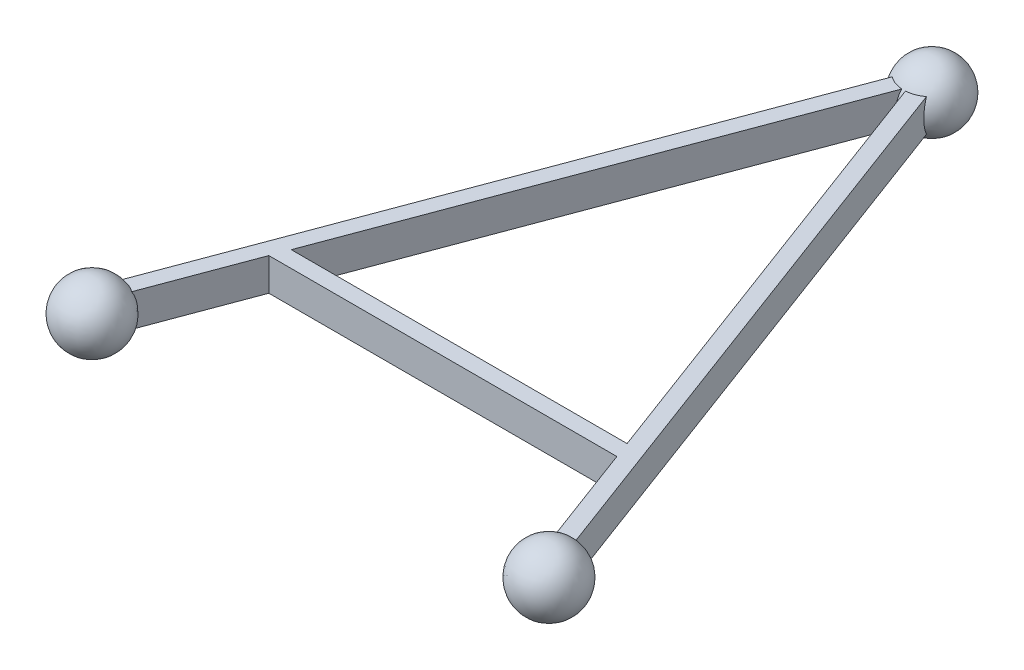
ISO-10303-21;
HEADER;
FILE_DESCRIPTION(('STEP AP214'),'2;1');
FILE_NAME('part.step','',(''),(''),'','','');
FILE_SCHEMA(('AUTOMOTIVE_DESIGN { 1 0 10303 214 1 1 1 1 }'));
ENDSEC;
DATA;
#1=APPLICATION_CONTEXT('core data for automotive mechanical design processes');
#2=APPLICATION_PROTOCOL_DEFINITION('international standard','automotive_design',2000,#1);
#3=PRODUCT_CONTEXT('',#1,'mechanical');
#4=PRODUCT('Part','Part','',(#3));
#5=PRODUCT_RELATED_PRODUCT_CATEGORY('part','',(#4));
#6=PRODUCT_DEFINITION_FORMATION('','',#4);
#7=PRODUCT_DEFINITION_CONTEXT('part definition',#1,'design');
#8=PRODUCT_DEFINITION('design','',#6,#7);
#9=PRODUCT_DEFINITION_SHAPE('','',#8);
#10=(LENGTH_UNIT() NAMED_UNIT(*) SI_UNIT(.MILLI.,.METRE.));
#11=(NAMED_UNIT(*) PLANE_ANGLE_UNIT() SI_UNIT($,.RADIAN.));
#12=(NAMED_UNIT(*) SI_UNIT($,.STERADIAN.) SOLID_ANGLE_UNIT());
#13=UNCERTAINTY_MEASURE_WITH_UNIT(LENGTH_MEASURE(1.E-05),#10,'distance_accuracy_value','');
#14=(GEOMETRIC_REPRESENTATION_CONTEXT(3) GLOBAL_UNCERTAINTY_ASSIGNED_CONTEXT((#13)) GLOBAL_UNIT_ASSIGNED_CONTEXT((#10,
#11,#12)) REPRESENTATION_CONTEXT('',''));
#15=CARTESIAN_POINT('',(0.,0.,0.));
#16=DIRECTION('',(0.,0.,1.));
#17=DIRECTION('',(1.,0.,0.));
#18=AXIS2_PLACEMENT_3D('',#15,#16,#17);
#19=CARTESIAN_POINT('',(-108.484483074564,6.35,-281.279448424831));
#20=DIRECTION('',(0.93674969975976,0.,-0.35));
#21=DIRECTION('',(-0.35,0.,-0.93674969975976));
#22=AXIS2_PLACEMENT_3D('',#19,#20,#21);
#23=PLANE('',#22);
#24=DIRECTION('',(0.35,0.,0.93674969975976));
#25=VECTOR('',#24,1.);
#26=CARTESIAN_POINT('',(-108.484483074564,6.35,-281.279448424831));
#27=LINE('',#26,#25);
#28=CARTESIAN_POINT('',(-21.1836203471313,6.35,-47.625));
#29=VERTEX_POINT('',#28);
#30=CARTESIAN_POINT('',(-6.65977959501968,6.35,-8.75299010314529));
#31=VERTEX_POINT('',#30);
#32=EDGE_CURVE('E55',#29,#31,#27,.T.);
#33=ORIENTED_EDGE('',*,*,#32,.F.);
#34=DIRECTION('',(0.,-1.,0.));
#35=VECTOR('',#34,1.);
#36=CARTESIAN_POINT('',(-21.1836203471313,6.35,-47.625));
#37=LINE('',#36,#35);
#38=CARTESIAN_POINT('',(-21.1836203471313,-6.35000000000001,-47.625));
#39=VERTEX_POINT('',#38);
#40=EDGE_CURVE('E170',#29,#39,#37,.T.);
#41=ORIENTED_EDGE('',*,*,#40,.T.);
#42=DIRECTION('',(0.35,0.,0.93674969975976));
#43=VECTOR('',#42,1.);
#44=CARTESIAN_POINT('',(-108.484483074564,-6.35,-281.279448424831));
#45=LINE('',#44,#43);
#46=CARTESIAN_POINT('',(-6.65977959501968,-6.35,-8.75299010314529));
#47=VERTEX_POINT('',#46);
#48=EDGE_CURVE('E180',#39,#47,#45,.T.);
#49=ORIENTED_EDGE('',*,*,#48,.T.);
#50=CARTESIAN_POINT('',(-2.97418029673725,0.,1.11125));
#51=DIRECTION('',(0.93674969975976,0.,-0.35));
#52=DIRECTION('',(-0.35,0.,-0.93674969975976));
#53=AXIS2_PLACEMENT_3D('',#50,#51,#52);
#54=CIRCLE('',#53,12.2967221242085);
#55=EDGE_CURVE('E203',#31,#47,#54,.F.);
#56=ORIENTED_EDGE('',*,*,#55,.F.);
#57=EDGE_LOOP('',(#33,#41,#49,#56));
#58=FACE_BOUND('',#57,.T.);
#59=ADVANCED_FACE('F32',(#58),#23,.F.);
#60=CARTESIAN_POINT('',(-69.3155169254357,6.35,-281.279448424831));
#61=DIRECTION('',(0.93674969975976,0.,0.35));
#62=DIRECTION('',(0.35,0.,-0.93674969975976));
#63=AXIS2_PLACEMENT_3D('',#60,#61,#62);
#64=PLANE('',#63);
#65=DIRECTION('',(0.,1.,0.));
#66=VECTOR('',#65,1.);
#67=CARTESIAN_POINT('',(-156.616379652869,6.34999999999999,-47.625));
#68=LINE('',#67,#66);
#69=CARTESIAN_POINT('',(-156.616379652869,-6.35,-47.6249999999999));
#70=VERTEX_POINT('',#69);
#71=CARTESIAN_POINT('',(-156.616379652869,6.34999999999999,-47.625));
#72=VERTEX_POINT('',#71);
#73=EDGE_CURVE('E142',#70,#72,#68,.T.);
#74=ORIENTED_EDGE('',*,*,#73,.T.);
#75=DIRECTION('',(-0.35,0.,0.93674969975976));
#76=VECTOR('',#75,1.);
#77=CARTESIAN_POINT('',(-69.3155169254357,6.35,-281.279448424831));
#78=LINE('',#77,#76);
#79=CARTESIAN_POINT('',(-171.14022040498,6.35,-8.75299010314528));
#80=VERTEX_POINT('',#79);
#81=EDGE_CURVE('E165',#72,#80,#78,.T.);
#82=ORIENTED_EDGE('',*,*,#81,.T.);
#83=CARTESIAN_POINT('',(-174.825819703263,0.,1.11125000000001));
#84=DIRECTION('',(0.93674969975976,0.,0.35));
#85=DIRECTION('',(0.35,0.,-0.93674969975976));
#86=AXIS2_PLACEMENT_3D('',#83,#84,#85);
#87=CIRCLE('',#86,12.2967221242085);
#88=CARTESIAN_POINT('',(-171.14022040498,-6.35,-8.75299010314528));
#89=VERTEX_POINT('',#88);
#90=EDGE_CURVE('E152',#89,#80,#87,.T.);
#91=ORIENTED_EDGE('',*,*,#90,.F.);
#92=DIRECTION('',(-0.35,0.,0.93674969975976));
#93=VECTOR('',#92,1.);
#94=CARTESIAN_POINT('',(-69.3155169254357,-6.35,-281.279448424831));
#95=LINE('',#94,#93);
#96=EDGE_CURVE('E149',#70,#89,#95,.T.);
#97=ORIENTED_EDGE('',*,*,#96,.F.);
#98=EDGE_LOOP('',(#74,#82,#91,#97));
#99=FACE_BOUND('',#98,.T.);
#100=ADVANCED_FACE('F232',(#99),#64,.T.);
#101=CARTESIAN_POINT('',(-108.484483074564,-6.35,-281.279448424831));
#102=DIRECTION('',(0.,1.,0.));
#103=DIRECTION('',(-1.,0.,0.));
#104=AXIS2_PLACEMENT_3D('',#101,#102,#103);
#105=PLANE('',#104);
#106=DIRECTION('',(1.,0.,0.));
#107=VECTOR('',#106,1.);
#108=CARTESIAN_POINT('',(-170.108495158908,-6.35000000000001,-53.975));
#109=LINE('',#108,#107);
#110=CARTESIAN_POINT('',(-154.24381417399,-6.35000000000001,-53.975));
#111=VERTEX_POINT('',#110);
#112=CARTESIAN_POINT('',(-23.55618582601,-6.35,-53.9750000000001));
#113=VERTEX_POINT('',#112);
#114=EDGE_CURVE('E121',#111,#113,#109,.T.);
#115=ORIENTED_EDGE('',*,*,#114,.T.);
#116=CARTESIAN_POINT('',(-88.1885809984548,-6.35,-226.958933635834));
#117=VERTEX_POINT('',#116);
#118=EDGE_CURVE('E47',#117,#113,#45,.T.);
#119=ORIENTED_EDGE('',*,*,#118,.F.);
#120=CARTESIAN_POINT('',(-88.9,-6.35,-237.934423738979));
#121=DIRECTION('',(0.,1.,0.));
#122=DIRECTION('',(-1.,0.,0.));
#123=AXIS2_PLACEMENT_3D('',#120,#121,#122);
#124=CIRCLE('',#123,10.9985226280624);
#125=CARTESIAN_POINT('',(-82.2402204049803,-6.35,-229.181433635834));
#126=VERTEX_POINT('',#125);
#127=EDGE_CURVE('E191',#126,#117,#124,.F.);
#128=ORIENTED_EDGE('',*,*,#127,.F.);
#129=DIRECTION('',(0.35,0.,0.93674969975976));
#130=VECTOR('',#129,1.);
#131=CARTESIAN_POINT('',(-102.53612248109,-6.35,-283.501948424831));
#132=LINE('',#131,#130);
#133=CARTESIAN_POINT('',(-0.711419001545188,-6.35,-10.9754901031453));
#134=VERTEX_POINT('',#133);
#135=EDGE_CURVE('E193',#126,#134,#132,.T.);
#136=ORIENTED_EDGE('',*,*,#135,.T.);
#137=CARTESIAN_POINT('',(0.,-6.35,0.));
#138=DIRECTION('',(0.,1.,0.));
#139=DIRECTION('',(-1.,0.,0.));
#140=AXIS2_PLACEMENT_3D('',#137,#138,#139);
#141=CIRCLE('',#140,10.9985226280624);
#142=EDGE_CURVE('E11',#47,#134,#141,.F.);
#143=ORIENTED_EDGE('',*,*,#142,.F.);
#144=ORIENTED_EDGE('',*,*,#48,.F.);
#145=DIRECTION('',(1.,0.,0.));
#146=VECTOR('',#145,1.);
#147=CARTESIAN_POINT('',(-170.108495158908,-6.35000000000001,-47.625));
#148=LINE('',#147,#146);
#149=EDGE_CURVE('E131',#70,#39,#148,.T.);
#150=ORIENTED_EDGE('',*,*,#149,.F.);
#151=ORIENTED_EDGE('',*,*,#96,.T.);
#152=CARTESIAN_POINT('',(-177.8,-6.35,0.));
#153=DIRECTION('',(0.,-1.,0.));
#154=DIRECTION('',(0.,0.,-1.));
#155=AXIS2_PLACEMENT_3D('',#152,#153,#154);
#156=CIRCLE('',#155,10.9985226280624);
#157=CARTESIAN_POINT('',(-177.088580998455,-6.35,-10.9754901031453));
#158=VERTEX_POINT('',#157);
#159=EDGE_CURVE('E148',#158,#89,#156,.T.);
#160=ORIENTED_EDGE('',*,*,#159,.F.);
#161=DIRECTION('',(-0.35,0.,0.93674969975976));
#162=VECTOR('',#161,1.);
#163=CARTESIAN_POINT('',(-75.2638775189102,-6.35,-283.501948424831));
#164=LINE('',#163,#162);
#165=CARTESIAN_POINT('',(-95.5597795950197,-6.35,-229.181433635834));
#166=VERTEX_POINT('',#165);
#167=EDGE_CURVE('E157',#166,#158,#164,.T.);
#168=ORIENTED_EDGE('',*,*,#167,.F.);
#169=CARTESIAN_POINT('',(-88.9,-6.35,-237.934423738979));
#170=DIRECTION('',(0.,-1.,0.));
#171=DIRECTION('',(0.,0.,-1.));
#172=AXIS2_PLACEMENT_3D('',#169,#170,#171);
#173=CIRCLE('',#172,10.9985226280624);
#174=CARTESIAN_POINT('',(-89.6114190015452,-6.35,-226.958933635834));
#175=VERTEX_POINT('',#174);
#176=EDGE_CURVE('E147',#166,#175,#173,.F.);
#177=ORIENTED_EDGE('',*,*,#176,.T.);
#178=EDGE_CURVE('E138',#175,#111,#95,.T.);
#179=ORIENTED_EDGE('',*,*,#178,.T.);
#180=EDGE_LOOP('',(#115,#119,#128,#136,#143,#144,#150,#151,#160,#168,#177,#179));
#181=FACE_BOUND('',#180,.T.);
#182=ADVANCED_FACE('F145',(#181),#105,.F.);
#183=CARTESIAN_POINT('',(-102.53612248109,6.35,-283.501948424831));
#184=DIRECTION('',(-0.93674969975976,0.,0.35));
#185=DIRECTION('',(0.35,0.,0.93674969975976));
#186=AXIS2_PLACEMENT_3D('',#183,#184,#185);
#187=PLANE('',#186);
#188=CARTESIAN_POINT('',(2.97418029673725,0.,-1.11125));
#189=DIRECTION('',(-0.93674969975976,0.,0.35));
#190=DIRECTION('',(0.35,0.,0.93674969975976));
#191=AXIS2_PLACEMENT_3D('',#188,#189,#190);
#192=CIRCLE('',#191,12.2967221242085);
#193=CARTESIAN_POINT('',(-0.711419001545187,6.35,-10.9754901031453));
#194=VERTEX_POINT('',#193);
#195=EDGE_CURVE('E40',#134,#194,#192,.F.);
#196=ORIENTED_EDGE('',*,*,#195,.F.);
#197=ORIENTED_EDGE('',*,*,#135,.F.);
#198=CARTESIAN_POINT('',(-85.9258197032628,0.,-239.045673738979));
#199=DIRECTION('',(-0.93674969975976,0.,0.35));
#200=DIRECTION('',(0.35,0.,0.93674969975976));
#201=AXIS2_PLACEMENT_3D('',#198,#199,#200);
#202=CIRCLE('',#201,12.2967221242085);
#203=CARTESIAN_POINT('',(-82.2402204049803,6.34999999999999,-229.181433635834));
#204=VERTEX_POINT('',#203);
#205=EDGE_CURVE('E181',#204,#126,#202,.F.);
#206=ORIENTED_EDGE('',*,*,#205,.F.);
#207=DIRECTION('',(0.35,0.,0.93674969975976));
#208=VECTOR('',#207,1.);
#209=CARTESIAN_POINT('',(-102.53612248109,6.35,-283.501948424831));
#210=LINE('',#209,#208);
#211=EDGE_CURVE('E196',#204,#194,#210,.T.);
#212=ORIENTED_EDGE('',*,*,#211,.T.);
#213=EDGE_LOOP('',(#196,#197,#206,#212));
#214=FACE_BOUND('',#213,.T.);
#215=ADVANCED_FACE('F212',(#214),#187,.F.);
#216=CARTESIAN_POINT('',(-108.484483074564,6.35,-281.279448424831));
#217=DIRECTION('',(0.,-1.,0.));
#218=DIRECTION('',(1.,0.,0.));
#219=AXIS2_PLACEMENT_3D('',#216,#217,#218);
#220=PLANE('',#219);
#221=DIRECTION('',(1.,0.,0.));
#222=VECTOR('',#221,1.);
#223=CARTESIAN_POINT('',(-170.108495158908,6.34999999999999,-47.625));
#224=LINE('',#223,#222);
#225=EDGE_CURVE('E143',#72,#29,#224,.T.);
#226=ORIENTED_EDGE('',*,*,#225,.T.);
#227=ORIENTED_EDGE('',*,*,#32,.T.);
#228=CARTESIAN_POINT('',(0.,6.35,0.));
#229=DIRECTION('',(0.,-1.,0.));
#230=DIRECTION('',(1.,0.,0.));
#231=AXIS2_PLACEMENT_3D('',#228,#229,#230);
#232=CIRCLE('',#231,10.9985226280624);
#233=EDGE_CURVE('E206',#194,#31,#232,.F.);
#234=ORIENTED_EDGE('',*,*,#233,.F.);
#235=ORIENTED_EDGE('',*,*,#211,.F.);
#236=CARTESIAN_POINT('',(-88.9,6.35,-237.934423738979));
#237=DIRECTION('',(0.,-1.,0.));
#238=DIRECTION('',(1.,0.,0.));
#239=AXIS2_PLACEMENT_3D('',#236,#237,#238);
#240=CIRCLE('',#239,10.9985226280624);
#241=CARTESIAN_POINT('',(-88.1885809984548,6.35,-226.958933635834));
#242=VERTEX_POINT('',#241);
#243=EDGE_CURVE('E184',#242,#204,#240,.F.);
#244=ORIENTED_EDGE('',*,*,#243,.F.);
#245=CARTESIAN_POINT('',(-23.55618582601,6.35,-53.9750000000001));
#246=VERTEX_POINT('',#245);
#247=EDGE_CURVE('E185',#242,#246,#27,.T.);
#248=ORIENTED_EDGE('',*,*,#247,.T.);
#249=DIRECTION('',(1.,0.,0.));
#250=VECTOR('',#249,1.);
#251=CARTESIAN_POINT('',(-170.108495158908,6.34999999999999,-53.975));
#252=LINE('',#251,#250);
#253=CARTESIAN_POINT('',(-154.24381417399,6.34999999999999,-53.975));
#254=VERTEX_POINT('',#253);
#255=EDGE_CURVE('E130',#254,#246,#252,.T.);
#256=ORIENTED_EDGE('',*,*,#255,.F.);
#257=CARTESIAN_POINT('',(-89.6114190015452,6.35,-226.958933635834));
#258=VERTEX_POINT('',#257);
#259=EDGE_CURVE('E141',#258,#254,#78,.T.);
#260=ORIENTED_EDGE('',*,*,#259,.F.);
#261=CARTESIAN_POINT('',(-88.9,6.35,-237.934423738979));
#262=DIRECTION('',(0.,1.,0.));
#263=DIRECTION('',(0.,0.,1.));
#264=AXIS2_PLACEMENT_3D('',#261,#262,#263);
#265=CIRCLE('',#264,10.9985226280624);
#266=CARTESIAN_POINT('',(-95.5597795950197,6.35,-229.181433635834));
#267=VERTEX_POINT('',#266);
#268=EDGE_CURVE('E160',#258,#267,#265,.F.);
#269=ORIENTED_EDGE('',*,*,#268,.T.);
#270=DIRECTION('',(-0.35,0.,0.93674969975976));
#271=VECTOR('',#270,1.);
#272=CARTESIAN_POINT('',(-75.2638775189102,6.35,-283.501948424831));
#273=LINE('',#272,#271);
#274=CARTESIAN_POINT('',(-177.088580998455,6.35,-10.9754901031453));
#275=VERTEX_POINT('',#274);
#276=EDGE_CURVE('E166',#267,#275,#273,.T.);
#277=ORIENTED_EDGE('',*,*,#276,.T.);
#278=CARTESIAN_POINT('',(-177.8,6.35,0.));
#279=DIRECTION('',(0.,1.,0.));
#280=DIRECTION('',(0.,0.,1.));
#281=AXIS2_PLACEMENT_3D('',#278,#279,#280);
#282=CIRCLE('',#281,10.9985226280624);
#283=EDGE_CURVE('E174',#80,#275,#282,.T.);
#284=ORIENTED_EDGE('',*,*,#283,.F.);
#285=ORIENTED_EDGE('',*,*,#81,.F.);
#286=EDGE_LOOP('',(#226,#227,#234,#235,#244,#248,#256,#260,#269,#277,#284,#285));
#287=FACE_BOUND('',#286,.T.);
#288=ADVANCED_FACE('F220',(#287),#220,.F.);
#289=ORIENTED_EDGE('',*,*,#118,.T.);
#290=DIRECTION('',(0.,1.,0.));
#291=VECTOR('',#290,1.);
#292=CARTESIAN_POINT('',(-23.55618582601,6.35,-53.975));
#293=LINE('',#292,#291);
#294=EDGE_CURVE('E127',#113,#246,#293,.T.);
#295=ORIENTED_EDGE('',*,*,#294,.T.);
#296=ORIENTED_EDGE('',*,*,#247,.F.);
#297=CARTESIAN_POINT('',(-91.8741802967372,0.,-236.823173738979));
#298=DIRECTION('',(0.93674969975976,0.,-0.35));
#299=DIRECTION('',(-0.35,0.,-0.93674969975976));
#300=AXIS2_PLACEMENT_3D('',#297,#298,#299);
#301=CIRCLE('',#300,12.2967221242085);
#302=EDGE_CURVE('E188',#117,#242,#301,.F.);
#303=ORIENTED_EDGE('',*,*,#302,.F.);
#304=EDGE_LOOP('',(#289,#295,#296,#303));
#305=FACE_BOUND('',#304,.T.);
#306=ADVANCED_FACE('F245',(#305),#23,.F.);
#307=CARTESIAN_POINT('',(0.,0.,0.));
#308=DIRECTION('',(0.,1.,0.));
#309=DIRECTION('',(1.,0.,0.));
#310=AXIS2_PLACEMENT_3D('',#307,#308,#309);
#311=SPHERICAL_SURFACE('',#310,12.7);
#312=ORIENTED_EDGE('',*,*,#55,.T.);
#313=ORIENTED_EDGE('',*,*,#142,.T.);
#314=ORIENTED_EDGE('',*,*,#195,.T.);
#315=ORIENTED_EDGE('',*,*,#233,.T.);
#316=EDGE_LOOP('',(#312,#313,#314,#315));
#317=FACE_BOUND('',#316,.T.);
#318=ADVANCED_FACE('F34',(#317),#311,.T.);
#319=CARTESIAN_POINT('',(-88.9,0.,-237.934423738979));
#320=DIRECTION('',(0.,-1.,0.));
#321=DIRECTION('',(0.35,0.,0.93674969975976));
#322=AXIS2_PLACEMENT_3D('',#319,#320,#321);
#323=SPHERICAL_SURFACE('',#322,12.7);
#324=CARTESIAN_POINT('',(-91.8741802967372,0.,-239.045673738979));
#325=DIRECTION('',(-0.93674969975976,0.,-0.35));
#326=DIRECTION('',(-0.35,0.,0.93674969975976));
#327=AXIS2_PLACEMENT_3D('',#324,#325,#326);
#328=CIRCLE('',#327,12.2967221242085);
#329=EDGE_CURVE('E161',#267,#166,#328,.F.);
#330=ORIENTED_EDGE('',*,*,#329,.F.);
#331=ORIENTED_EDGE('',*,*,#268,.F.);
#332=CARTESIAN_POINT('',(-85.9258197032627,0.,-236.823173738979));
#333=DIRECTION('',(0.93674969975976,0.,0.35));
#334=DIRECTION('',(0.35,0.,-0.93674969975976));
#335=AXIS2_PLACEMENT_3D('',#332,#333,#334);
#336=CIRCLE('',#335,12.2967221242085);
#337=EDGE_CURVE('E163',#175,#258,#336,.F.);
#338=ORIENTED_EDGE('',*,*,#337,.F.);
#339=ORIENTED_EDGE('',*,*,#176,.F.);
#340=EDGE_LOOP('',(#330,#331,#338,#339));
#341=FACE_BOUND('',#340,.T.);
#342=ORIENTED_EDGE('',*,*,#205,.T.);
#343=ORIENTED_EDGE('',*,*,#127,.T.);
#344=ORIENTED_EDGE('',*,*,#302,.T.);
#345=ORIENTED_EDGE('',*,*,#243,.T.);
#346=EDGE_LOOP('',(#342,#343,#344,#345));
#347=FACE_BOUND('',#346,.T.);
#348=ADVANCED_FACE('F216',(#341,#347),#323,.T.);
#349=CARTESIAN_POINT('',(-75.2638775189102,6.35,-283.501948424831));
#350=DIRECTION('',(-0.93674969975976,0.,-0.35));
#351=DIRECTION('',(-0.35,0.,0.93674969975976));
#352=AXIS2_PLACEMENT_3D('',#349,#350,#351);
#353=PLANE('',#352);
#354=CARTESIAN_POINT('',(-180.774180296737,0.,-1.11124999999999));
#355=DIRECTION('',(-0.93674969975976,0.,-0.35));
#356=DIRECTION('',(-0.35,0.,0.93674969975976));
#357=AXIS2_PLACEMENT_3D('',#354,#355,#356);
#358=CIRCLE('',#357,12.2967221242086);
#359=EDGE_CURVE('E177',#275,#158,#358,.T.);
#360=ORIENTED_EDGE('',*,*,#359,.F.);
#361=ORIENTED_EDGE('',*,*,#276,.F.);
#362=ORIENTED_EDGE('',*,*,#329,.T.);
#363=ORIENTED_EDGE('',*,*,#167,.T.);
#364=EDGE_LOOP('',(#360,#361,#362,#363));
#365=FACE_BOUND('',#364,.T.);
#366=ADVANCED_FACE('F237',(#365),#353,.T.);
#367=DIRECTION('',(0.,-1.,0.));
#368=VECTOR('',#367,1.);
#369=CARTESIAN_POINT('',(-154.24381417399,6.34999999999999,-53.975));
#370=LINE('',#369,#368);
#371=EDGE_CURVE('E125',#254,#111,#370,.T.);
#372=ORIENTED_EDGE('',*,*,#371,.T.);
#373=ORIENTED_EDGE('',*,*,#178,.F.);
#374=ORIENTED_EDGE('',*,*,#337,.T.);
#375=ORIENTED_EDGE('',*,*,#259,.T.);
#376=EDGE_LOOP('',(#372,#373,#374,#375));
#377=FACE_BOUND('',#376,.T.);
#378=ADVANCED_FACE('F136',(#377),#64,.T.);
#379=CARTESIAN_POINT('',(-177.8,0.,0.));
#380=DIRECTION('',(0.,1.,0.));
#381=DIRECTION('',(-1.,0.,0.));
#382=AXIS2_PLACEMENT_3D('',#379,#380,#381);
#383=SPHERICAL_SURFACE('',#382,12.7);
#384=ORIENTED_EDGE('',*,*,#283,.T.);
#385=ORIENTED_EDGE('',*,*,#359,.T.);
#386=ORIENTED_EDGE('',*,*,#159,.T.);
#387=ORIENTED_EDGE('',*,*,#90,.T.);
#388=EDGE_LOOP('',(#384,#385,#386,#387));
#389=FACE_BOUND('',#388,.T.);
#390=ADVANCED_FACE('F235',(#389),#383,.T.);
#391=CARTESIAN_POINT('',(-170.108495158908,6.34999999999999,-47.625));
#392=DIRECTION('',(0.,0.,1.));
#393=DIRECTION('',(1.,0.,0.));
#394=AXIS2_PLACEMENT_3D('',#391,#392,#393);
#395=PLANE('',#394);
#396=ORIENTED_EDGE('',*,*,#40,.F.);
#397=ORIENTED_EDGE('',*,*,#225,.F.);
#398=ORIENTED_EDGE('',*,*,#73,.F.);
#399=ORIENTED_EDGE('',*,*,#149,.T.);
#400=EDGE_LOOP('',(#396,#397,#398,#399));
#401=FACE_BOUND('',#400,.T.);
#402=ADVANCED_FACE('F229',(#401),#395,.T.);
#403=CARTESIAN_POINT('',(-170.108495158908,6.34999999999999,-53.975));
#404=DIRECTION('',(0.,0.,-1.));
#405=DIRECTION('',(-1.,0.,0.));
#406=AXIS2_PLACEMENT_3D('',#403,#404,#405);
#407=PLANE('',#406);
#408=ORIENTED_EDGE('',*,*,#294,.F.);
#409=ORIENTED_EDGE('',*,*,#114,.F.);
#410=ORIENTED_EDGE('',*,*,#371,.F.);
#411=ORIENTED_EDGE('',*,*,#255,.T.);
#412=EDGE_LOOP('',(#408,#409,#410,#411));
#413=FACE_BOUND('',#412,.T.);
#414=ADVANCED_FACE('F123',(#413),#407,.T.);
#415=CLOSED_SHELL('',(#59,#100,#182,#215,#288,#306,#318,#348,#366,#378,#390,#402,#414));
#416=MANIFOLD_SOLID_BREP('B2',#415);
#417=ADVANCED_BREP_SHAPE_REPRESENTATION('',(#18,#416),#14);
#418=SHAPE_DEFINITION_REPRESENTATION(#9,#417);
ENDSEC;
END-ISO-10303-21;
